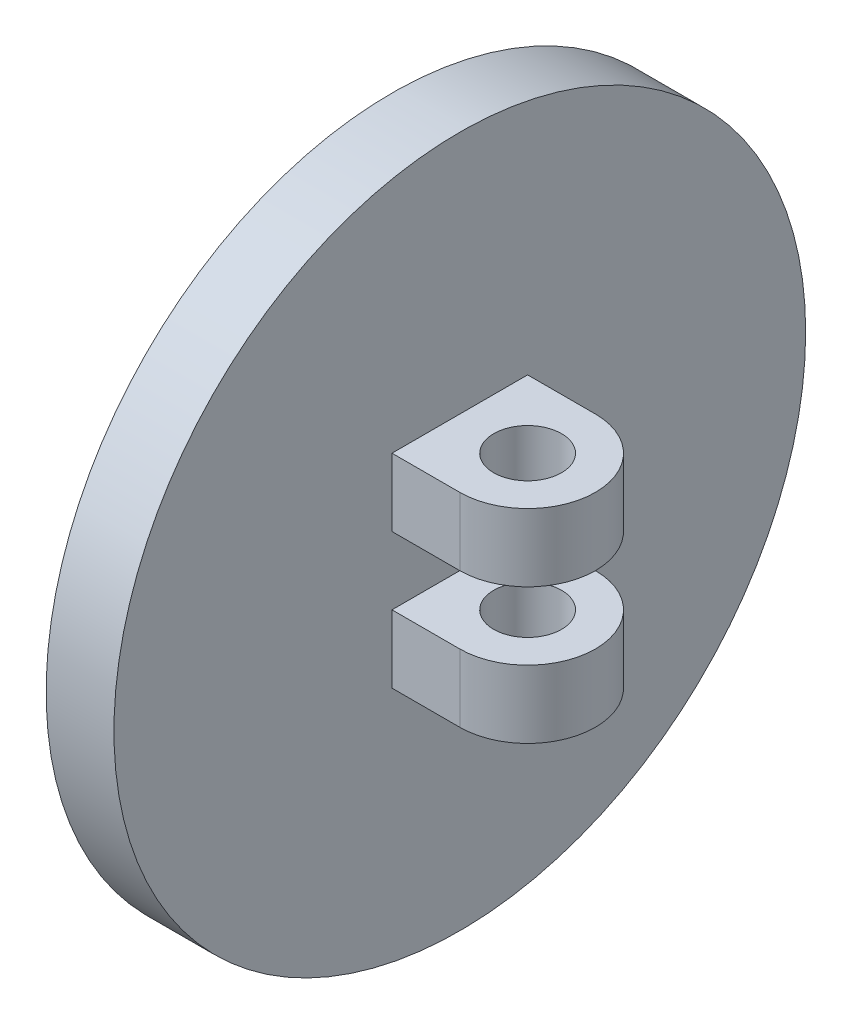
from build123d import *

# Parameters (mm, degrees)
SKETCH1_R           = 5.1
BOSS_EXTRUDE1_DEPTH = 1
BOSS_EXTRUDE2_START = 0.5
SKETCH2_R           = 0.5
BOSS_EXTRUDE2_DEPTH = 1


with BuildPart() as part:
    # Sketch1 → Boss-Extrude1 (new body)
    with BuildSketch(Plane(origin=(0, 0, 0), x_dir=(0, 0, -1), z_dir=(1, 0, 0))):
        Circle(SKETCH1_R)
    extrude(amount=BOSS_EXTRUDE1_DEPTH)

    # Sketch2 → Boss-Extrude2 (add)
    with BuildSketch(Plane(origin=(0, 0, 0), x_dir=(1, 0, 0), z_dir=(0, 1, 0)).offset(BOSS_EXTRUDE2_START)):
        with BuildLine():
            Line((1, 1), (2, 1))
            ThreePointArc((2, 1), (3, 0), (2, -1))
            Line((2, -1), (1, -1))
            Line((1, -1), (1, 1))
        make_face()
        with Locations(Location((2, 0, 0), (0, 0, 270))):
            Circle(SKETCH2_R, mode=Mode.SUBTRACT)
    boss_extrude2 = extrude(amount=BOSS_EXTRUDE2_DEPTH)

    # Mirror1: Boss-Extrude2 across plane
    add(boss_extrude2.mirror(Plane.ZX))


solid = part.part
